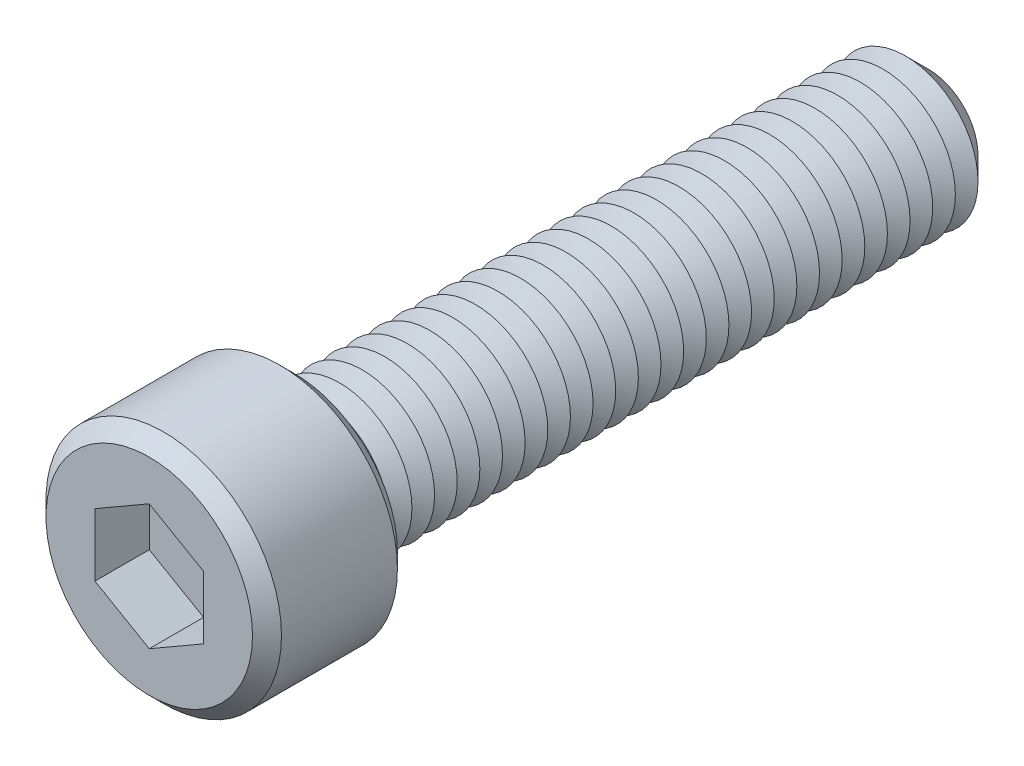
ISO-10303-21;
HEADER;
FILE_DESCRIPTION(('STEP AP214'),'2;1');
FILE_NAME('part.step','',(''),(''),'','','');
FILE_SCHEMA(('AUTOMOTIVE_DESIGN { 1 0 10303 214 1 1 1 1 }'));
ENDSEC;
DATA;
#1=APPLICATION_CONTEXT('core data for automotive mechanical design processes');
#2=APPLICATION_PROTOCOL_DEFINITION('international standard','automotive_design',2000,#1);
#3=PRODUCT_CONTEXT('',#1,'mechanical');
#4=PRODUCT('Part','Part','',(#3));
#5=PRODUCT_RELATED_PRODUCT_CATEGORY('part','',(#4));
#6=PRODUCT_DEFINITION_FORMATION('','',#4);
#7=PRODUCT_DEFINITION_CONTEXT('part definition',#1,'design');
#8=PRODUCT_DEFINITION('design','',#6,#7);
#9=PRODUCT_DEFINITION_SHAPE('','',#8);
#10=(LENGTH_UNIT() NAMED_UNIT(*) SI_UNIT(.MILLI.,.METRE.));
#11=(NAMED_UNIT(*) PLANE_ANGLE_UNIT() SI_UNIT($,.RADIAN.));
#12=(NAMED_UNIT(*) SI_UNIT($,.STERADIAN.) SOLID_ANGLE_UNIT());
#13=UNCERTAINTY_MEASURE_WITH_UNIT(LENGTH_MEASURE(1.E-05),#10,'distance_accuracy_value','');
#14=(GEOMETRIC_REPRESENTATION_CONTEXT(3) GLOBAL_UNCERTAINTY_ASSIGNED_CONTEXT((#13)) GLOBAL_UNIT_ASSIGNED_CONTEXT((#10,
#11,#12)) REPRESENTATION_CONTEXT('',''));
#15=CARTESIAN_POINT('',(0.,0.,0.));
#16=DIRECTION('',(0.,0.,1.));
#17=DIRECTION('',(1.,0.,0.));
#18=AXIS2_PLACEMENT_3D('',#15,#16,#17);
#19=CARTESIAN_POINT('',(0.,0.,8.));
#20=DIRECTION('',(0.,0.,-1.));
#21=DIRECTION('',(-1.,0.,0.));
#22=AXIS2_PLACEMENT_3D('',#19,#20,#21);
#23=CYLINDRICAL_SURFACE('',#22,6.5);
#24=CARTESIAN_POINT('',(0.,0.,0.80000000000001));
#25=DIRECTION('',(0.,0.,1.));
#26=DIRECTION('',(1.,0.,0.));
#27=AXIS2_PLACEMENT_3D('',#24,#25,#26);
#28=CIRCLE('',#27,6.5);
#29=CARTESIAN_POINT('',(6.5,0.,0.80000000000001));
#30=VERTEX_POINT('',#29);
#31=EDGE_CURVE('E392',#30,#30,#28,.T.);
#32=ORIENTED_EDGE('',*,*,#31,.T.);
#33=EDGE_LOOP('',(#32));
#34=FACE_BOUND('',#33,.T.);
#35=CARTESIAN_POINT('',(0.,0.,7.19999999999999));
#36=DIRECTION('',(0.,0.,1.));
#37=DIRECTION('',(1.,0.,0.));
#38=AXIS2_PLACEMENT_3D('',#35,#36,#37);
#39=CIRCLE('',#38,6.5);
#40=CARTESIAN_POINT('',(6.5,0.,7.19999999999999));
#41=VERTEX_POINT('',#40);
#42=EDGE_CURVE('E388',#41,#41,#39,.F.);
#43=ORIENTED_EDGE('',*,*,#42,.T.);
#44=EDGE_LOOP('',(#43));
#45=FACE_BOUND('',#44,.T.);
#46=ADVANCED_FACE('F39',(#34,#45),#23,.T.);
#47=CARTESIAN_POINT('',(0.,0.,8.));
#48=DIRECTION('',(0.,0.,1.));
#49=DIRECTION('',(1.,0.,0.));
#50=AXIS2_PLACEMENT_3D('',#47,#48,#49);
#51=PLANE('',#50);
#52=CARTESIAN_POINT('',(0.,0.,8.));
#53=DIRECTION('',(0.,0.,1.));
#54=DIRECTION('',(1.,0.,0.));
#55=AXIS2_PLACEMENT_3D('',#52,#53,#54);
#56=CIRCLE('',#55,5.69999999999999);
#57=CARTESIAN_POINT('',(5.69999999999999,0.,8.));
#58=VERTEX_POINT('',#57);
#59=EDGE_CURVE('E11',#58,#58,#56,.T.);
#60=ORIENTED_EDGE('',*,*,#59,.T.);
#61=EDGE_LOOP('',(#60));
#62=FACE_BOUND('',#61,.T.);
#63=DIRECTION('',(-0.866025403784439,0.5,0.));
#64=VECTOR('',#63,1.);
#65=CARTESIAN_POINT('',(3.,1.73205080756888,8.));
#66=LINE('',#65,#64);
#67=CARTESIAN_POINT('',(3.,1.73205080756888,8.));
#68=VERTEX_POINT('',#67);
#69=CARTESIAN_POINT('',(0.,3.46410161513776,8.));
#70=VERTEX_POINT('',#69);
#71=EDGE_CURVE('E55',#68,#70,#66,.T.);
#72=ORIENTED_EDGE('',*,*,#71,.F.);
#73=DIRECTION('',(0.,1.,0.));
#74=VECTOR('',#73,1.);
#75=CARTESIAN_POINT('',(3.,-1.73205080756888,8.));
#76=LINE('',#75,#74);
#77=CARTESIAN_POINT('',(3.,-1.73205080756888,8.));
#78=VERTEX_POINT('',#77);
#79=EDGE_CURVE('E150',#78,#68,#76,.T.);
#80=ORIENTED_EDGE('',*,*,#79,.F.);
#81=DIRECTION('',(0.866025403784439,0.5,0.));
#82=VECTOR('',#81,1.);
#83=CARTESIAN_POINT('',(0.,-3.46410161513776,8.));
#84=LINE('',#83,#82);
#85=CARTESIAN_POINT('',(0.,-3.46410161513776,8.));
#86=VERTEX_POINT('',#85);
#87=EDGE_CURVE('E147',#86,#78,#84,.T.);
#88=ORIENTED_EDGE('',*,*,#87,.F.);
#89=DIRECTION('',(0.866025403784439,-0.5,0.));
#90=VECTOR('',#89,1.);
#91=CARTESIAN_POINT('',(-3.,-1.73205080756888,8.));
#92=LINE('',#91,#90);
#93=CARTESIAN_POINT('',(-3.,-1.73205080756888,8.));
#94=VERTEX_POINT('',#93);
#95=EDGE_CURVE('E103',#94,#86,#92,.T.);
#96=ORIENTED_EDGE('',*,*,#95,.F.);
#97=DIRECTION('',(0.,-1.,0.));
#98=VECTOR('',#97,1.);
#99=CARTESIAN_POINT('',(-3.,1.73205080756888,8.));
#100=LINE('',#99,#98);
#101=CARTESIAN_POINT('',(-3.,1.73205080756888,8.));
#102=VERTEX_POINT('',#101);
#103=EDGE_CURVE('E141',#102,#94,#100,.T.);
#104=ORIENTED_EDGE('',*,*,#103,.F.);
#105=DIRECTION('',(-0.866025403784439,-0.5,0.));
#106=VECTOR('',#105,1.);
#107=CARTESIAN_POINT('',(0.,3.46410161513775,8.));
#108=LINE('',#107,#106);
#109=EDGE_CURVE('E136',#70,#102,#108,.T.);
#110=ORIENTED_EDGE('',*,*,#109,.F.);
#111=EDGE_LOOP('',(#72,#80,#88,#96,#104,#110));
#112=FACE_BOUND('',#111,.T.);
#113=ADVANCED_FACE('F410',(#62,#112),#51,.T.);
#114=CARTESIAN_POINT('',(0.,0.,0.));
#115=DIRECTION('',(0.,0.,1.));
#116=DIRECTION('',(1.,0.,0.));
#117=AXIS2_PLACEMENT_3D('',#114,#115,#116);
#118=PLANE('',#117);
#119=CARTESIAN_POINT('',(0.,0.,0.));
#120=DIRECTION('',(0.,0.,1.));
#121=DIRECTION('',(1.,0.,0.));
#122=AXIS2_PLACEMENT_3D('',#119,#120,#121);
#123=CIRCLE('',#122,5.69999999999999);
#124=CARTESIAN_POINT('',(5.69999999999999,0.,0.));
#125=VERTEX_POINT('',#124);
#126=EDGE_CURVE('E48',#125,#125,#123,.F.);
#127=ORIENTED_EDGE('',*,*,#126,.T.);
#128=EDGE_LOOP('',(#127));
#129=FACE_BOUND('',#128,.T.);
#130=CARTESIAN_POINT('',(0.,0.,0.));
#131=DIRECTION('',(0.,0.,1.));
#132=DIRECTION('',(1.,0.,0.));
#133=AXIS2_PLACEMENT_3D('',#130,#131,#132);
#134=CIRCLE('',#133,4.);
#135=CARTESIAN_POINT('',(4.,0.,0.));
#136=VERTEX_POINT('',#135);
#137=EDGE_CURVE('E380',#136,#136,#134,.T.);
#138=ORIENTED_EDGE('',*,*,#137,.T.);
#139=EDGE_LOOP('',(#138));
#140=FACE_BOUND('',#139,.T.);
#141=ADVANCED_FACE('F399',(#129,#140),#118,.F.);
#142=CARTESIAN_POINT('',(0.,0.,0.));
#143=DIRECTION('',(0.,0.,1.));
#144=DIRECTION('',(1.,0.,0.));
#145=AXIS2_PLACEMENT_3D('',#142,#143,#144);
#146=CONICAL_SURFACE('',#145,4.,1.0471975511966);
#147=CARTESIAN_POINT('',(0.,0.,-0.624999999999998));
#148=DIRECTION('',(0.,0.,1.));
#149=DIRECTION('',(1.,0.,0.));
#150=AXIS2_PLACEMENT_3D('',#147,#148,#149);
#151=CIRCLE('',#150,2.91746824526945);
#152=CARTESIAN_POINT('',(2.91746824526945,0.,-0.624999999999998));
#153=VERTEX_POINT('',#152);
#154=EDGE_CURVE('E376',#153,#153,#151,.T.);
#155=ORIENTED_EDGE('',*,*,#154,.T.);
#156=EDGE_LOOP('',(#155));
#157=FACE_BOUND('',#156,.T.);
#158=ORIENTED_EDGE('',*,*,#137,.F.);
#159=EDGE_LOOP('',(#158));
#160=FACE_BOUND('',#159,.T.);
#161=ADVANCED_FACE('F676',(#157,#160),#146,.T.);
#162=CARTESIAN_POINT('',(0.,0.,-0.624999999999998));
#163=DIRECTION('',(0.,0.,-1.));
#164=DIRECTION('',(-1.,0.,0.));
#165=AXIS2_PLACEMENT_3D('',#162,#163,#164);
#166=CONICAL_SURFACE('',#165,2.91746824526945,1.0471975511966);
#167=CARTESIAN_POINT('',(0.,0.,-1.25));
#168=DIRECTION('',(0.,0.,1.));
#169=DIRECTION('',(1.,0.,0.));
#170=AXIS2_PLACEMENT_3D('',#167,#168,#169);
#171=CIRCLE('',#170,4.);
#172=CARTESIAN_POINT('',(4.,0.,-1.25));
#173=VERTEX_POINT('',#172);
#174=EDGE_CURVE('E372',#173,#173,#171,.T.);
#175=ORIENTED_EDGE('',*,*,#174,.T.);
#176=EDGE_LOOP('',(#175));
#177=FACE_BOUND('',#176,.T.);
#178=ORIENTED_EDGE('',*,*,#154,.F.);
#179=EDGE_LOOP('',(#178));
#180=FACE_BOUND('',#179,.T.);
#181=ADVANCED_FACE('F672',(#177,#180),#166,.T.);
#182=CARTESIAN_POINT('',(0.,0.,-1.25));
#183=DIRECTION('',(0.,0.,1.));
#184=DIRECTION('',(1.,0.,0.));
#185=AXIS2_PLACEMENT_3D('',#182,#183,#184);
#186=CONICAL_SURFACE('',#185,4.,1.0471975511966);
#187=CARTESIAN_POINT('',(0.,0.,-1.875));
#188=DIRECTION('',(0.,0.,1.));
#189=DIRECTION('',(1.,0.,0.));
#190=AXIS2_PLACEMENT_3D('',#187,#188,#189);
#191=CIRCLE('',#190,2.91746824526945);
#192=CARTESIAN_POINT('',(2.91746824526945,0.,-1.875));
#193=VERTEX_POINT('',#192);
#194=EDGE_CURVE('E368',#193,#193,#191,.T.);
#195=ORIENTED_EDGE('',*,*,#194,.T.);
#196=EDGE_LOOP('',(#195));
#197=FACE_BOUND('',#196,.T.);
#198=ORIENTED_EDGE('',*,*,#174,.F.);
#199=EDGE_LOOP('',(#198));
#200=FACE_BOUND('',#199,.T.);
#201=ADVANCED_FACE('F668',(#197,#200),#186,.T.);
#202=CARTESIAN_POINT('',(0.,0.,-1.875));
#203=DIRECTION('',(0.,0.,-1.));
#204=DIRECTION('',(-1.,0.,0.));
#205=AXIS2_PLACEMENT_3D('',#202,#203,#204);
#206=CONICAL_SURFACE('',#205,2.91746824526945,1.0471975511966);
#207=CARTESIAN_POINT('',(0.,0.,-2.5));
#208=DIRECTION('',(0.,0.,1.));
#209=DIRECTION('',(1.,0.,0.));
#210=AXIS2_PLACEMENT_3D('',#207,#208,#209);
#211=CIRCLE('',#210,4.);
#212=CARTESIAN_POINT('',(4.,0.,-2.5));
#213=VERTEX_POINT('',#212);
#214=EDGE_CURVE('E364',#213,#213,#211,.T.);
#215=ORIENTED_EDGE('',*,*,#214,.T.);
#216=EDGE_LOOP('',(#215));
#217=FACE_BOUND('',#216,.T.);
#218=ORIENTED_EDGE('',*,*,#194,.F.);
#219=EDGE_LOOP('',(#218));
#220=FACE_BOUND('',#219,.T.);
#221=ADVANCED_FACE('F664',(#217,#220),#206,.T.);
#222=CARTESIAN_POINT('',(0.,0.,-2.5));
#223=DIRECTION('',(0.,0.,1.));
#224=DIRECTION('',(1.,0.,0.));
#225=AXIS2_PLACEMENT_3D('',#222,#223,#224);
#226=CONICAL_SURFACE('',#225,4.,1.0471975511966);
#227=CARTESIAN_POINT('',(0.,0.,-3.125));
#228=DIRECTION('',(0.,0.,1.));
#229=DIRECTION('',(1.,0.,0.));
#230=AXIS2_PLACEMENT_3D('',#227,#228,#229);
#231=CIRCLE('',#230,2.91746824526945);
#232=CARTESIAN_POINT('',(2.91746824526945,0.,-3.125));
#233=VERTEX_POINT('',#232);
#234=EDGE_CURVE('E360',#233,#233,#231,.T.);
#235=ORIENTED_EDGE('',*,*,#234,.T.);
#236=EDGE_LOOP('',(#235));
#237=FACE_BOUND('',#236,.T.);
#238=ORIENTED_EDGE('',*,*,#214,.F.);
#239=EDGE_LOOP('',(#238));
#240=FACE_BOUND('',#239,.T.);
#241=ADVANCED_FACE('F660',(#237,#240),#226,.T.);
#242=CARTESIAN_POINT('',(0.,0.,-3.125));
#243=DIRECTION('',(0.,0.,-1.));
#244=DIRECTION('',(-1.,0.,0.));
#245=AXIS2_PLACEMENT_3D('',#242,#243,#244);
#246=CONICAL_SURFACE('',#245,2.91746824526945,1.0471975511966);
#247=CARTESIAN_POINT('',(0.,0.,-3.75));
#248=DIRECTION('',(0.,0.,1.));
#249=DIRECTION('',(1.,0.,0.));
#250=AXIS2_PLACEMENT_3D('',#247,#248,#249);
#251=CIRCLE('',#250,4.);
#252=CARTESIAN_POINT('',(4.,0.,-3.75));
#253=VERTEX_POINT('',#252);
#254=EDGE_CURVE('E356',#253,#253,#251,.T.);
#255=ORIENTED_EDGE('',*,*,#254,.T.);
#256=EDGE_LOOP('',(#255));
#257=FACE_BOUND('',#256,.T.);
#258=ORIENTED_EDGE('',*,*,#234,.F.);
#259=EDGE_LOOP('',(#258));
#260=FACE_BOUND('',#259,.T.);
#261=ADVANCED_FACE('F656',(#257,#260),#246,.T.);
#262=CARTESIAN_POINT('',(0.,0.,-3.75));
#263=DIRECTION('',(0.,0.,1.));
#264=DIRECTION('',(1.,0.,0.));
#265=AXIS2_PLACEMENT_3D('',#262,#263,#264);
#266=CONICAL_SURFACE('',#265,4.,1.0471975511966);
#267=CARTESIAN_POINT('',(0.,0.,-4.375));
#268=DIRECTION('',(0.,0.,1.));
#269=DIRECTION('',(1.,0.,0.));
#270=AXIS2_PLACEMENT_3D('',#267,#268,#269);
#271=CIRCLE('',#270,2.91746824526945);
#272=CARTESIAN_POINT('',(2.91746824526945,0.,-4.375));
#273=VERTEX_POINT('',#272);
#274=EDGE_CURVE('E352',#273,#273,#271,.T.);
#275=ORIENTED_EDGE('',*,*,#274,.T.);
#276=EDGE_LOOP('',(#275));
#277=FACE_BOUND('',#276,.T.);
#278=ORIENTED_EDGE('',*,*,#254,.F.);
#279=EDGE_LOOP('',(#278));
#280=FACE_BOUND('',#279,.T.);
#281=ADVANCED_FACE('F652',(#277,#280),#266,.T.);
#282=CARTESIAN_POINT('',(0.,0.,-4.375));
#283=DIRECTION('',(0.,0.,-1.));
#284=DIRECTION('',(-1.,0.,0.));
#285=AXIS2_PLACEMENT_3D('',#282,#283,#284);
#286=CONICAL_SURFACE('',#285,2.91746824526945,1.0471975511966);
#287=CARTESIAN_POINT('',(0.,0.,-5.));
#288=DIRECTION('',(0.,0.,1.));
#289=DIRECTION('',(1.,0.,0.));
#290=AXIS2_PLACEMENT_3D('',#287,#288,#289);
#291=CIRCLE('',#290,4.);
#292=CARTESIAN_POINT('',(4.,0.,-5.));
#293=VERTEX_POINT('',#292);
#294=EDGE_CURVE('E348',#293,#293,#291,.T.);
#295=ORIENTED_EDGE('',*,*,#294,.T.);
#296=EDGE_LOOP('',(#295));
#297=FACE_BOUND('',#296,.T.);
#298=ORIENTED_EDGE('',*,*,#274,.F.);
#299=EDGE_LOOP('',(#298));
#300=FACE_BOUND('',#299,.T.);
#301=ADVANCED_FACE('F648',(#297,#300),#286,.T.);
#302=CARTESIAN_POINT('',(0.,0.,-5.));
#303=DIRECTION('',(0.,0.,1.));
#304=DIRECTION('',(1.,0.,0.));
#305=AXIS2_PLACEMENT_3D('',#302,#303,#304);
#306=CONICAL_SURFACE('',#305,4.,1.0471975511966);
#307=CARTESIAN_POINT('',(0.,0.,-5.625));
#308=DIRECTION('',(0.,0.,1.));
#309=DIRECTION('',(1.,0.,0.));
#310=AXIS2_PLACEMENT_3D('',#307,#308,#309);
#311=CIRCLE('',#310,2.91746824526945);
#312=CARTESIAN_POINT('',(2.91746824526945,0.,-5.625));
#313=VERTEX_POINT('',#312);
#314=EDGE_CURVE('E344',#313,#313,#311,.T.);
#315=ORIENTED_EDGE('',*,*,#314,.T.);
#316=EDGE_LOOP('',(#315));
#317=FACE_BOUND('',#316,.T.);
#318=ORIENTED_EDGE('',*,*,#294,.F.);
#319=EDGE_LOOP('',(#318));
#320=FACE_BOUND('',#319,.T.);
#321=ADVANCED_FACE('F644',(#317,#320),#306,.T.);
#322=CARTESIAN_POINT('',(0.,0.,-5.625));
#323=DIRECTION('',(0.,0.,-1.));
#324=DIRECTION('',(-1.,0.,0.));
#325=AXIS2_PLACEMENT_3D('',#322,#323,#324);
#326=CONICAL_SURFACE('',#325,2.91746824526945,1.0471975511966);
#327=CARTESIAN_POINT('',(0.,0.,-6.25));
#328=DIRECTION('',(0.,0.,1.));
#329=DIRECTION('',(1.,0.,0.));
#330=AXIS2_PLACEMENT_3D('',#327,#328,#329);
#331=CIRCLE('',#330,4.);
#332=CARTESIAN_POINT('',(4.,0.,-6.25));
#333=VERTEX_POINT('',#332);
#334=EDGE_CURVE('E340',#333,#333,#331,.T.);
#335=ORIENTED_EDGE('',*,*,#334,.T.);
#336=EDGE_LOOP('',(#335));
#337=FACE_BOUND('',#336,.T.);
#338=ORIENTED_EDGE('',*,*,#314,.F.);
#339=EDGE_LOOP('',(#338));
#340=FACE_BOUND('',#339,.T.);
#341=ADVANCED_FACE('F640',(#337,#340),#326,.T.);
#342=CARTESIAN_POINT('',(0.,0.,-6.25));
#343=DIRECTION('',(0.,0.,1.));
#344=DIRECTION('',(1.,0.,0.));
#345=AXIS2_PLACEMENT_3D('',#342,#343,#344);
#346=CONICAL_SURFACE('',#345,4.,1.0471975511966);
#347=CARTESIAN_POINT('',(0.,0.,-6.875));
#348=DIRECTION('',(0.,0.,1.));
#349=DIRECTION('',(1.,0.,0.));
#350=AXIS2_PLACEMENT_3D('',#347,#348,#349);
#351=CIRCLE('',#350,2.91746824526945);
#352=CARTESIAN_POINT('',(2.91746824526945,0.,-6.875));
#353=VERTEX_POINT('',#352);
#354=EDGE_CURVE('E336',#353,#353,#351,.T.);
#355=ORIENTED_EDGE('',*,*,#354,.T.);
#356=EDGE_LOOP('',(#355));
#357=FACE_BOUND('',#356,.T.);
#358=ORIENTED_EDGE('',*,*,#334,.F.);
#359=EDGE_LOOP('',(#358));
#360=FACE_BOUND('',#359,.T.);
#361=ADVANCED_FACE('F636',(#357,#360),#346,.T.);
#362=CARTESIAN_POINT('',(0.,0.,-6.875));
#363=DIRECTION('',(0.,0.,-1.));
#364=DIRECTION('',(-1.,0.,0.));
#365=AXIS2_PLACEMENT_3D('',#362,#363,#364);
#366=CONICAL_SURFACE('',#365,2.91746824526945,1.0471975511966);
#367=CARTESIAN_POINT('',(0.,0.,-7.5));
#368=DIRECTION('',(0.,0.,1.));
#369=DIRECTION('',(1.,0.,0.));
#370=AXIS2_PLACEMENT_3D('',#367,#368,#369);
#371=CIRCLE('',#370,4.);
#372=CARTESIAN_POINT('',(4.,0.,-7.5));
#373=VERTEX_POINT('',#372);
#374=EDGE_CURVE('E332',#373,#373,#371,.T.);
#375=ORIENTED_EDGE('',*,*,#374,.T.);
#376=EDGE_LOOP('',(#375));
#377=FACE_BOUND('',#376,.T.);
#378=ORIENTED_EDGE('',*,*,#354,.F.);
#379=EDGE_LOOP('',(#378));
#380=FACE_BOUND('',#379,.T.);
#381=ADVANCED_FACE('F632',(#377,#380),#366,.T.);
#382=CARTESIAN_POINT('',(0.,0.,-7.5));
#383=DIRECTION('',(0.,0.,1.));
#384=DIRECTION('',(1.,0.,0.));
#385=AXIS2_PLACEMENT_3D('',#382,#383,#384);
#386=CONICAL_SURFACE('',#385,4.,1.0471975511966);
#387=CARTESIAN_POINT('',(0.,0.,-8.125));
#388=DIRECTION('',(0.,0.,1.));
#389=DIRECTION('',(1.,0.,0.));
#390=AXIS2_PLACEMENT_3D('',#387,#388,#389);
#391=CIRCLE('',#390,2.91746824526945);
#392=CARTESIAN_POINT('',(2.91746824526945,0.,-8.125));
#393=VERTEX_POINT('',#392);
#394=EDGE_CURVE('E328',#393,#393,#391,.T.);
#395=ORIENTED_EDGE('',*,*,#394,.T.);
#396=EDGE_LOOP('',(#395));
#397=FACE_BOUND('',#396,.T.);
#398=ORIENTED_EDGE('',*,*,#374,.F.);
#399=EDGE_LOOP('',(#398));
#400=FACE_BOUND('',#399,.T.);
#401=ADVANCED_FACE('F628',(#397,#400),#386,.T.);
#402=CARTESIAN_POINT('',(0.,0.,-8.125));
#403=DIRECTION('',(0.,0.,-1.));
#404=DIRECTION('',(-1.,0.,0.));
#405=AXIS2_PLACEMENT_3D('',#402,#403,#404);
#406=CONICAL_SURFACE('',#405,2.91746824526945,1.0471975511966);
#407=CARTESIAN_POINT('',(0.,0.,-8.75));
#408=DIRECTION('',(0.,0.,1.));
#409=DIRECTION('',(1.,0.,0.));
#410=AXIS2_PLACEMENT_3D('',#407,#408,#409);
#411=CIRCLE('',#410,4.);
#412=CARTESIAN_POINT('',(4.,0.,-8.75));
#413=VERTEX_POINT('',#412);
#414=EDGE_CURVE('E324',#413,#413,#411,.T.);
#415=ORIENTED_EDGE('',*,*,#414,.T.);
#416=EDGE_LOOP('',(#415));
#417=FACE_BOUND('',#416,.T.);
#418=ORIENTED_EDGE('',*,*,#394,.F.);
#419=EDGE_LOOP('',(#418));
#420=FACE_BOUND('',#419,.T.);
#421=ADVANCED_FACE('F624',(#417,#420),#406,.T.);
#422=CARTESIAN_POINT('',(0.,0.,-8.75));
#423=DIRECTION('',(0.,0.,1.));
#424=DIRECTION('',(1.,0.,0.));
#425=AXIS2_PLACEMENT_3D('',#422,#423,#424);
#426=CONICAL_SURFACE('',#425,4.,1.0471975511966);
#427=CARTESIAN_POINT('',(0.,0.,-9.375));
#428=DIRECTION('',(0.,0.,1.));
#429=DIRECTION('',(1.,0.,0.));
#430=AXIS2_PLACEMENT_3D('',#427,#428,#429);
#431=CIRCLE('',#430,2.91746824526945);
#432=CARTESIAN_POINT('',(2.91746824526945,0.,-9.375));
#433=VERTEX_POINT('',#432);
#434=EDGE_CURVE('E320',#433,#433,#431,.T.);
#435=ORIENTED_EDGE('',*,*,#434,.T.);
#436=EDGE_LOOP('',(#435));
#437=FACE_BOUND('',#436,.T.);
#438=ORIENTED_EDGE('',*,*,#414,.F.);
#439=EDGE_LOOP('',(#438));
#440=FACE_BOUND('',#439,.T.);
#441=ADVANCED_FACE('F620',(#437,#440),#426,.T.);
#442=CARTESIAN_POINT('',(0.,0.,-9.375));
#443=DIRECTION('',(0.,0.,-1.));
#444=DIRECTION('',(-1.,0.,0.));
#445=AXIS2_PLACEMENT_3D('',#442,#443,#444);
#446=CONICAL_SURFACE('',#445,2.91746824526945,1.0471975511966);
#447=CARTESIAN_POINT('',(0.,0.,-10.));
#448=DIRECTION('',(0.,0.,1.));
#449=DIRECTION('',(1.,0.,0.));
#450=AXIS2_PLACEMENT_3D('',#447,#448,#449);
#451=CIRCLE('',#450,4.);
#452=CARTESIAN_POINT('',(4.,0.,-10.));
#453=VERTEX_POINT('',#452);
#454=EDGE_CURVE('E316',#453,#453,#451,.T.);
#455=ORIENTED_EDGE('',*,*,#454,.T.);
#456=EDGE_LOOP('',(#455));
#457=FACE_BOUND('',#456,.T.);
#458=ORIENTED_EDGE('',*,*,#434,.F.);
#459=EDGE_LOOP('',(#458));
#460=FACE_BOUND('',#459,.T.);
#461=ADVANCED_FACE('F616',(#457,#460),#446,.T.);
#462=CARTESIAN_POINT('',(0.,0.,-10.));
#463=DIRECTION('',(0.,0.,1.));
#464=DIRECTION('',(1.,0.,0.));
#465=AXIS2_PLACEMENT_3D('',#462,#463,#464);
#466=CONICAL_SURFACE('',#465,4.,1.0471975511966);
#467=CARTESIAN_POINT('',(0.,0.,-10.625));
#468=DIRECTION('',(0.,0.,1.));
#469=DIRECTION('',(1.,0.,0.));
#470=AXIS2_PLACEMENT_3D('',#467,#468,#469);
#471=CIRCLE('',#470,2.91746824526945);
#472=CARTESIAN_POINT('',(2.91746824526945,0.,-10.625));
#473=VERTEX_POINT('',#472);
#474=EDGE_CURVE('E312',#473,#473,#471,.T.);
#475=ORIENTED_EDGE('',*,*,#474,.T.);
#476=EDGE_LOOP('',(#475));
#477=FACE_BOUND('',#476,.T.);
#478=ORIENTED_EDGE('',*,*,#454,.F.);
#479=EDGE_LOOP('',(#478));
#480=FACE_BOUND('',#479,.T.);
#481=ADVANCED_FACE('F612',(#477,#480),#466,.T.);
#482=CARTESIAN_POINT('',(0.,0.,-10.625));
#483=DIRECTION('',(0.,0.,-1.));
#484=DIRECTION('',(-1.,0.,0.));
#485=AXIS2_PLACEMENT_3D('',#482,#483,#484);
#486=CONICAL_SURFACE('',#485,2.91746824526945,1.0471975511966);
#487=CARTESIAN_POINT('',(0.,0.,-11.25));
#488=DIRECTION('',(0.,0.,1.));
#489=DIRECTION('',(1.,0.,0.));
#490=AXIS2_PLACEMENT_3D('',#487,#488,#489);
#491=CIRCLE('',#490,4.);
#492=CARTESIAN_POINT('',(4.,0.,-11.25));
#493=VERTEX_POINT('',#492);
#494=EDGE_CURVE('E308',#493,#493,#491,.T.);
#495=ORIENTED_EDGE('',*,*,#494,.T.);
#496=EDGE_LOOP('',(#495));
#497=FACE_BOUND('',#496,.T.);
#498=ORIENTED_EDGE('',*,*,#474,.F.);
#499=EDGE_LOOP('',(#498));
#500=FACE_BOUND('',#499,.T.);
#501=ADVANCED_FACE('F608',(#497,#500),#486,.T.);
#502=CARTESIAN_POINT('',(0.,0.,-11.25));
#503=DIRECTION('',(0.,0.,1.));
#504=DIRECTION('',(1.,0.,0.));
#505=AXIS2_PLACEMENT_3D('',#502,#503,#504);
#506=CONICAL_SURFACE('',#505,4.,1.0471975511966);
#507=CARTESIAN_POINT('',(0.,0.,-11.875));
#508=DIRECTION('',(0.,0.,1.));
#509=DIRECTION('',(1.,0.,0.));
#510=AXIS2_PLACEMENT_3D('',#507,#508,#509);
#511=CIRCLE('',#510,2.91746824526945);
#512=CARTESIAN_POINT('',(2.91746824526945,0.,-11.875));
#513=VERTEX_POINT('',#512);
#514=EDGE_CURVE('E304',#513,#513,#511,.T.);
#515=ORIENTED_EDGE('',*,*,#514,.T.);
#516=EDGE_LOOP('',(#515));
#517=FACE_BOUND('',#516,.T.);
#518=ORIENTED_EDGE('',*,*,#494,.F.);
#519=EDGE_LOOP('',(#518));
#520=FACE_BOUND('',#519,.T.);
#521=ADVANCED_FACE('F604',(#517,#520),#506,.T.);
#522=CARTESIAN_POINT('',(0.,0.,-11.875));
#523=DIRECTION('',(0.,0.,-1.));
#524=DIRECTION('',(-1.,0.,0.));
#525=AXIS2_PLACEMENT_3D('',#522,#523,#524);
#526=CONICAL_SURFACE('',#525,2.91746824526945,1.0471975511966);
#527=CARTESIAN_POINT('',(0.,0.,-12.5));
#528=DIRECTION('',(0.,0.,1.));
#529=DIRECTION('',(1.,0.,0.));
#530=AXIS2_PLACEMENT_3D('',#527,#528,#529);
#531=CIRCLE('',#530,4.);
#532=CARTESIAN_POINT('',(4.,0.,-12.5));
#533=VERTEX_POINT('',#532);
#534=EDGE_CURVE('E300',#533,#533,#531,.T.);
#535=ORIENTED_EDGE('',*,*,#534,.T.);
#536=EDGE_LOOP('',(#535));
#537=FACE_BOUND('',#536,.T.);
#538=ORIENTED_EDGE('',*,*,#514,.F.);
#539=EDGE_LOOP('',(#538));
#540=FACE_BOUND('',#539,.T.);
#541=ADVANCED_FACE('F600',(#537,#540),#526,.T.);
#542=CARTESIAN_POINT('',(0.,0.,-12.5));
#543=DIRECTION('',(0.,0.,1.));
#544=DIRECTION('',(1.,0.,0.));
#545=AXIS2_PLACEMENT_3D('',#542,#543,#544);
#546=CONICAL_SURFACE('',#545,4.,1.0471975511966);
#547=CARTESIAN_POINT('',(0.,0.,-13.125));
#548=DIRECTION('',(0.,0.,1.));
#549=DIRECTION('',(1.,0.,0.));
#550=AXIS2_PLACEMENT_3D('',#547,#548,#549);
#551=CIRCLE('',#550,2.91746824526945);
#552=CARTESIAN_POINT('',(2.91746824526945,0.,-13.125));
#553=VERTEX_POINT('',#552);
#554=EDGE_CURVE('E296',#553,#553,#551,.T.);
#555=ORIENTED_EDGE('',*,*,#554,.T.);
#556=EDGE_LOOP('',(#555));
#557=FACE_BOUND('',#556,.T.);
#558=ORIENTED_EDGE('',*,*,#534,.F.);
#559=EDGE_LOOP('',(#558));
#560=FACE_BOUND('',#559,.T.);
#561=ADVANCED_FACE('F596',(#557,#560),#546,.T.);
#562=CARTESIAN_POINT('',(0.,0.,-13.125));
#563=DIRECTION('',(0.,0.,-1.));
#564=DIRECTION('',(-1.,0.,0.));
#565=AXIS2_PLACEMENT_3D('',#562,#563,#564);
#566=CONICAL_SURFACE('',#565,2.91746824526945,1.0471975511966);
#567=CARTESIAN_POINT('',(0.,0.,-13.75));
#568=DIRECTION('',(0.,0.,1.));
#569=DIRECTION('',(1.,0.,0.));
#570=AXIS2_PLACEMENT_3D('',#567,#568,#569);
#571=CIRCLE('',#570,4.);
#572=CARTESIAN_POINT('',(4.,0.,-13.75));
#573=VERTEX_POINT('',#572);
#574=EDGE_CURVE('E292',#573,#573,#571,.T.);
#575=ORIENTED_EDGE('',*,*,#574,.T.);
#576=EDGE_LOOP('',(#575));
#577=FACE_BOUND('',#576,.T.);
#578=ORIENTED_EDGE('',*,*,#554,.F.);
#579=EDGE_LOOP('',(#578));
#580=FACE_BOUND('',#579,.T.);
#581=ADVANCED_FACE('F592',(#577,#580),#566,.T.);
#582=CARTESIAN_POINT('',(0.,0.,-13.75));
#583=DIRECTION('',(0.,0.,1.));
#584=DIRECTION('',(1.,0.,0.));
#585=AXIS2_PLACEMENT_3D('',#582,#583,#584);
#586=CONICAL_SURFACE('',#585,4.,1.0471975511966);
#587=CARTESIAN_POINT('',(0.,0.,-14.375));
#588=DIRECTION('',(0.,0.,1.));
#589=DIRECTION('',(1.,0.,0.));
#590=AXIS2_PLACEMENT_3D('',#587,#588,#589);
#591=CIRCLE('',#590,2.91746824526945);
#592=CARTESIAN_POINT('',(2.91746824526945,0.,-14.375));
#593=VERTEX_POINT('',#592);
#594=EDGE_CURVE('E288',#593,#593,#591,.T.);
#595=ORIENTED_EDGE('',*,*,#594,.T.);
#596=EDGE_LOOP('',(#595));
#597=FACE_BOUND('',#596,.T.);
#598=ORIENTED_EDGE('',*,*,#574,.F.);
#599=EDGE_LOOP('',(#598));
#600=FACE_BOUND('',#599,.T.);
#601=ADVANCED_FACE('F588',(#597,#600),#586,.T.);
#602=CARTESIAN_POINT('',(0.,0.,-14.375));
#603=DIRECTION('',(0.,0.,-1.));
#604=DIRECTION('',(-1.,0.,0.));
#605=AXIS2_PLACEMENT_3D('',#602,#603,#604);
#606=CONICAL_SURFACE('',#605,2.91746824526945,1.0471975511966);
#607=CARTESIAN_POINT('',(0.,0.,-15.));
#608=DIRECTION('',(0.,0.,1.));
#609=DIRECTION('',(1.,0.,0.));
#610=AXIS2_PLACEMENT_3D('',#607,#608,#609);
#611=CIRCLE('',#610,4.);
#612=CARTESIAN_POINT('',(4.,0.,-15.));
#613=VERTEX_POINT('',#612);
#614=EDGE_CURVE('E284',#613,#613,#611,.T.);
#615=ORIENTED_EDGE('',*,*,#614,.T.);
#616=EDGE_LOOP('',(#615));
#617=FACE_BOUND('',#616,.T.);
#618=ORIENTED_EDGE('',*,*,#594,.F.);
#619=EDGE_LOOP('',(#618));
#620=FACE_BOUND('',#619,.T.);
#621=ADVANCED_FACE('F584',(#617,#620),#606,.T.);
#622=CARTESIAN_POINT('',(0.,0.,-15.));
#623=DIRECTION('',(0.,0.,1.));
#624=DIRECTION('',(1.,0.,0.));
#625=AXIS2_PLACEMENT_3D('',#622,#623,#624);
#626=CONICAL_SURFACE('',#625,4.,1.0471975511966);
#627=CARTESIAN_POINT('',(0.,0.,-15.625));
#628=DIRECTION('',(0.,0.,1.));
#629=DIRECTION('',(1.,0.,0.));
#630=AXIS2_PLACEMENT_3D('',#627,#628,#629);
#631=CIRCLE('',#630,2.91746824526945);
#632=CARTESIAN_POINT('',(2.91746824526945,0.,-15.625));
#633=VERTEX_POINT('',#632);
#634=EDGE_CURVE('E280',#633,#633,#631,.T.);
#635=ORIENTED_EDGE('',*,*,#634,.T.);
#636=EDGE_LOOP('',(#635));
#637=FACE_BOUND('',#636,.T.);
#638=ORIENTED_EDGE('',*,*,#614,.F.);
#639=EDGE_LOOP('',(#638));
#640=FACE_BOUND('',#639,.T.);
#641=ADVANCED_FACE('F580',(#637,#640),#626,.T.);
#642=CARTESIAN_POINT('',(0.,0.,-15.625));
#643=DIRECTION('',(0.,0.,-1.));
#644=DIRECTION('',(-1.,0.,0.));
#645=AXIS2_PLACEMENT_3D('',#642,#643,#644);
#646=CONICAL_SURFACE('',#645,2.91746824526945,1.0471975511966);
#647=CARTESIAN_POINT('',(0.,0.,-16.25));
#648=DIRECTION('',(0.,0.,1.));
#649=DIRECTION('',(1.,0.,0.));
#650=AXIS2_PLACEMENT_3D('',#647,#648,#649);
#651=CIRCLE('',#650,4.);
#652=CARTESIAN_POINT('',(4.,0.,-16.25));
#653=VERTEX_POINT('',#652);
#654=EDGE_CURVE('E276',#653,#653,#651,.T.);
#655=ORIENTED_EDGE('',*,*,#654,.T.);
#656=EDGE_LOOP('',(#655));
#657=FACE_BOUND('',#656,.T.);
#658=ORIENTED_EDGE('',*,*,#634,.F.);
#659=EDGE_LOOP('',(#658));
#660=FACE_BOUND('',#659,.T.);
#661=ADVANCED_FACE('F576',(#657,#660),#646,.T.);
#662=CARTESIAN_POINT('',(0.,0.,-16.25));
#663=DIRECTION('',(0.,0.,1.));
#664=DIRECTION('',(1.,0.,0.));
#665=AXIS2_PLACEMENT_3D('',#662,#663,#664);
#666=CONICAL_SURFACE('',#665,4.,1.0471975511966);
#667=CARTESIAN_POINT('',(0.,0.,-16.875));
#668=DIRECTION('',(0.,0.,1.));
#669=DIRECTION('',(1.,0.,0.));
#670=AXIS2_PLACEMENT_3D('',#667,#668,#669);
#671=CIRCLE('',#670,2.91746824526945);
#672=CARTESIAN_POINT('',(2.91746824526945,0.,-16.875));
#673=VERTEX_POINT('',#672);
#674=EDGE_CURVE('E272',#673,#673,#671,.T.);
#675=ORIENTED_EDGE('',*,*,#674,.T.);
#676=EDGE_LOOP('',(#675));
#677=FACE_BOUND('',#676,.T.);
#678=ORIENTED_EDGE('',*,*,#654,.F.);
#679=EDGE_LOOP('',(#678));
#680=FACE_BOUND('',#679,.T.);
#681=ADVANCED_FACE('F572',(#677,#680),#666,.T.);
#682=CARTESIAN_POINT('',(0.,0.,-16.875));
#683=DIRECTION('',(0.,0.,-1.));
#684=DIRECTION('',(-1.,0.,0.));
#685=AXIS2_PLACEMENT_3D('',#682,#683,#684);
#686=CONICAL_SURFACE('',#685,2.91746824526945,1.0471975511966);
#687=CARTESIAN_POINT('',(0.,0.,-17.5));
#688=DIRECTION('',(0.,0.,1.));
#689=DIRECTION('',(1.,0.,0.));
#690=AXIS2_PLACEMENT_3D('',#687,#688,#689);
#691=CIRCLE('',#690,4.);
#692=CARTESIAN_POINT('',(4.,0.,-17.5));
#693=VERTEX_POINT('',#692);
#694=EDGE_CURVE('E268',#693,#693,#691,.T.);
#695=ORIENTED_EDGE('',*,*,#694,.T.);
#696=EDGE_LOOP('',(#695));
#697=FACE_BOUND('',#696,.T.);
#698=ORIENTED_EDGE('',*,*,#674,.F.);
#699=EDGE_LOOP('',(#698));
#700=FACE_BOUND('',#699,.T.);
#701=ADVANCED_FACE('F568',(#697,#700),#686,.T.);
#702=CARTESIAN_POINT('',(0.,0.,-17.5));
#703=DIRECTION('',(0.,0.,1.));
#704=DIRECTION('',(1.,0.,0.));
#705=AXIS2_PLACEMENT_3D('',#702,#703,#704);
#706=CONICAL_SURFACE('',#705,4.,1.0471975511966);
#707=CARTESIAN_POINT('',(0.,0.,-18.125));
#708=DIRECTION('',(0.,0.,1.));
#709=DIRECTION('',(1.,0.,0.));
#710=AXIS2_PLACEMENT_3D('',#707,#708,#709);
#711=CIRCLE('',#710,2.91746824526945);
#712=CARTESIAN_POINT('',(2.91746824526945,0.,-18.125));
#713=VERTEX_POINT('',#712);
#714=EDGE_CURVE('E264',#713,#713,#711,.T.);
#715=ORIENTED_EDGE('',*,*,#714,.T.);
#716=EDGE_LOOP('',(#715));
#717=FACE_BOUND('',#716,.T.);
#718=ORIENTED_EDGE('',*,*,#694,.F.);
#719=EDGE_LOOP('',(#718));
#720=FACE_BOUND('',#719,.T.);
#721=ADVANCED_FACE('F564',(#717,#720),#706,.T.);
#722=CARTESIAN_POINT('',(0.,0.,-18.125));
#723=DIRECTION('',(0.,0.,-1.));
#724=DIRECTION('',(-1.,0.,0.));
#725=AXIS2_PLACEMENT_3D('',#722,#723,#724);
#726=CONICAL_SURFACE('',#725,2.91746824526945,1.0471975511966);
#727=CARTESIAN_POINT('',(0.,0.,-18.75));
#728=DIRECTION('',(0.,0.,1.));
#729=DIRECTION('',(1.,0.,0.));
#730=AXIS2_PLACEMENT_3D('',#727,#728,#729);
#731=CIRCLE('',#730,4.);
#732=CARTESIAN_POINT('',(4.,0.,-18.75));
#733=VERTEX_POINT('',#732);
#734=EDGE_CURVE('E260',#733,#733,#731,.T.);
#735=ORIENTED_EDGE('',*,*,#734,.T.);
#736=EDGE_LOOP('',(#735));
#737=FACE_BOUND('',#736,.T.);
#738=ORIENTED_EDGE('',*,*,#714,.F.);
#739=EDGE_LOOP('',(#738));
#740=FACE_BOUND('',#739,.T.);
#741=ADVANCED_FACE('F560',(#737,#740),#726,.T.);
#742=CARTESIAN_POINT('',(0.,0.,-18.75));
#743=DIRECTION('',(0.,0.,1.));
#744=DIRECTION('',(1.,0.,0.));
#745=AXIS2_PLACEMENT_3D('',#742,#743,#744);
#746=CONICAL_SURFACE('',#745,4.,1.0471975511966);
#747=CARTESIAN_POINT('',(0.,0.,-19.375));
#748=DIRECTION('',(0.,0.,1.));
#749=DIRECTION('',(1.,0.,0.));
#750=AXIS2_PLACEMENT_3D('',#747,#748,#749);
#751=CIRCLE('',#750,2.91746824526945);
#752=CARTESIAN_POINT('',(2.91746824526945,0.,-19.375));
#753=VERTEX_POINT('',#752);
#754=EDGE_CURVE('E256',#753,#753,#751,.T.);
#755=ORIENTED_EDGE('',*,*,#754,.T.);
#756=EDGE_LOOP('',(#755));
#757=FACE_BOUND('',#756,.T.);
#758=ORIENTED_EDGE('',*,*,#734,.F.);
#759=EDGE_LOOP('',(#758));
#760=FACE_BOUND('',#759,.T.);
#761=ADVANCED_FACE('F556',(#757,#760),#746,.T.);
#762=CARTESIAN_POINT('',(0.,0.,-19.375));
#763=DIRECTION('',(0.,0.,-1.));
#764=DIRECTION('',(-1.,0.,0.));
#765=AXIS2_PLACEMENT_3D('',#762,#763,#764);
#766=CONICAL_SURFACE('',#765,2.91746824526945,1.0471975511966);
#767=CARTESIAN_POINT('',(0.,0.,-20.));
#768=DIRECTION('',(0.,0.,1.));
#769=DIRECTION('',(1.,0.,0.));
#770=AXIS2_PLACEMENT_3D('',#767,#768,#769);
#771=CIRCLE('',#770,4.);
#772=CARTESIAN_POINT('',(4.,0.,-20.));
#773=VERTEX_POINT('',#772);
#774=EDGE_CURVE('E252',#773,#773,#771,.T.);
#775=ORIENTED_EDGE('',*,*,#774,.T.);
#776=EDGE_LOOP('',(#775));
#777=FACE_BOUND('',#776,.T.);
#778=ORIENTED_EDGE('',*,*,#754,.F.);
#779=EDGE_LOOP('',(#778));
#780=FACE_BOUND('',#779,.T.);
#781=ADVANCED_FACE('F552',(#777,#780),#766,.T.);
#782=CARTESIAN_POINT('',(0.,0.,-20.));
#783=DIRECTION('',(0.,0.,1.));
#784=DIRECTION('',(1.,0.,0.));
#785=AXIS2_PLACEMENT_3D('',#782,#783,#784);
#786=CONICAL_SURFACE('',#785,4.,1.0471975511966);
#787=CARTESIAN_POINT('',(0.,0.,-20.625));
#788=DIRECTION('',(0.,0.,1.));
#789=DIRECTION('',(1.,0.,0.));
#790=AXIS2_PLACEMENT_3D('',#787,#788,#789);
#791=CIRCLE('',#790,2.91746824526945);
#792=CARTESIAN_POINT('',(2.91746824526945,0.,-20.625));
#793=VERTEX_POINT('',#792);
#794=EDGE_CURVE('E248',#793,#793,#791,.T.);
#795=ORIENTED_EDGE('',*,*,#794,.T.);
#796=EDGE_LOOP('',(#795));
#797=FACE_BOUND('',#796,.T.);
#798=ORIENTED_EDGE('',*,*,#774,.F.);
#799=EDGE_LOOP('',(#798));
#800=FACE_BOUND('',#799,.T.);
#801=ADVANCED_FACE('F548',(#797,#800),#786,.T.);
#802=CARTESIAN_POINT('',(0.,0.,-20.625));
#803=DIRECTION('',(0.,0.,-1.));
#804=DIRECTION('',(-1.,0.,0.));
#805=AXIS2_PLACEMENT_3D('',#802,#803,#804);
#806=CONICAL_SURFACE('',#805,2.91746824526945,1.0471975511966);
#807=CARTESIAN_POINT('',(0.,0.,-21.25));
#808=DIRECTION('',(0.,0.,1.));
#809=DIRECTION('',(1.,0.,0.));
#810=AXIS2_PLACEMENT_3D('',#807,#808,#809);
#811=CIRCLE('',#810,4.);
#812=CARTESIAN_POINT('',(4.,0.,-21.25));
#813=VERTEX_POINT('',#812);
#814=EDGE_CURVE('E244',#813,#813,#811,.T.);
#815=ORIENTED_EDGE('',*,*,#814,.T.);
#816=EDGE_LOOP('',(#815));
#817=FACE_BOUND('',#816,.T.);
#818=ORIENTED_EDGE('',*,*,#794,.F.);
#819=EDGE_LOOP('',(#818));
#820=FACE_BOUND('',#819,.T.);
#821=ADVANCED_FACE('F544',(#817,#820),#806,.T.);
#822=CARTESIAN_POINT('',(0.,0.,-21.25));
#823=DIRECTION('',(0.,0.,1.));
#824=DIRECTION('',(1.,0.,0.));
#825=AXIS2_PLACEMENT_3D('',#822,#823,#824);
#826=CONICAL_SURFACE('',#825,4.,1.0471975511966);
#827=CARTESIAN_POINT('',(0.,0.,-21.875));
#828=DIRECTION('',(0.,0.,1.));
#829=DIRECTION('',(1.,0.,0.));
#830=AXIS2_PLACEMENT_3D('',#827,#828,#829);
#831=CIRCLE('',#830,2.91746824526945);
#832=CARTESIAN_POINT('',(2.91746824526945,0.,-21.875));
#833=VERTEX_POINT('',#832);
#834=EDGE_CURVE('E240',#833,#833,#831,.T.);
#835=ORIENTED_EDGE('',*,*,#834,.T.);
#836=EDGE_LOOP('',(#835));
#837=FACE_BOUND('',#836,.T.);
#838=ORIENTED_EDGE('',*,*,#814,.F.);
#839=EDGE_LOOP('',(#838));
#840=FACE_BOUND('',#839,.T.);
#841=ADVANCED_FACE('F540',(#837,#840),#826,.T.);
#842=CARTESIAN_POINT('',(0.,0.,-21.875));
#843=DIRECTION('',(0.,0.,-1.));
#844=DIRECTION('',(-1.,0.,0.));
#845=AXIS2_PLACEMENT_3D('',#842,#843,#844);
#846=CONICAL_SURFACE('',#845,2.91746824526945,1.0471975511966);
#847=CARTESIAN_POINT('',(0.,0.,-22.5));
#848=DIRECTION('',(0.,0.,1.));
#849=DIRECTION('',(1.,0.,0.));
#850=AXIS2_PLACEMENT_3D('',#847,#848,#849);
#851=CIRCLE('',#850,4.);
#852=CARTESIAN_POINT('',(4.,0.,-22.5));
#853=VERTEX_POINT('',#852);
#854=EDGE_CURVE('E236',#853,#853,#851,.T.);
#855=ORIENTED_EDGE('',*,*,#854,.T.);
#856=EDGE_LOOP('',(#855));
#857=FACE_BOUND('',#856,.T.);
#858=ORIENTED_EDGE('',*,*,#834,.F.);
#859=EDGE_LOOP('',(#858));
#860=FACE_BOUND('',#859,.T.);
#861=ADVANCED_FACE('F536',(#857,#860),#846,.T.);
#862=CARTESIAN_POINT('',(0.,0.,-22.5));
#863=DIRECTION('',(0.,0.,1.));
#864=DIRECTION('',(1.,0.,0.));
#865=AXIS2_PLACEMENT_3D('',#862,#863,#864);
#866=CONICAL_SURFACE('',#865,4.,1.0471975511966);
#867=CARTESIAN_POINT('',(0.,0.,-23.125));
#868=DIRECTION('',(0.,0.,1.));
#869=DIRECTION('',(1.,0.,0.));
#870=AXIS2_PLACEMENT_3D('',#867,#868,#869);
#871=CIRCLE('',#870,2.91746824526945);
#872=CARTESIAN_POINT('',(2.91746824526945,0.,-23.125));
#873=VERTEX_POINT('',#872);
#874=EDGE_CURVE('E232',#873,#873,#871,.T.);
#875=ORIENTED_EDGE('',*,*,#874,.T.);
#876=EDGE_LOOP('',(#875));
#877=FACE_BOUND('',#876,.T.);
#878=ORIENTED_EDGE('',*,*,#854,.F.);
#879=EDGE_LOOP('',(#878));
#880=FACE_BOUND('',#879,.T.);
#881=ADVANCED_FACE('F532',(#877,#880),#866,.T.);
#882=CARTESIAN_POINT('',(0.,0.,-23.125));
#883=DIRECTION('',(0.,0.,-1.));
#884=DIRECTION('',(-1.,0.,0.));
#885=AXIS2_PLACEMENT_3D('',#882,#883,#884);
#886=CONICAL_SURFACE('',#885,2.91746824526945,1.0471975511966);
#887=CARTESIAN_POINT('',(0.,0.,-23.75));
#888=DIRECTION('',(0.,0.,1.));
#889=DIRECTION('',(1.,0.,0.));
#890=AXIS2_PLACEMENT_3D('',#887,#888,#889);
#891=CIRCLE('',#890,4.);
#892=CARTESIAN_POINT('',(4.,0.,-23.75));
#893=VERTEX_POINT('',#892);
#894=EDGE_CURVE('E228',#893,#893,#891,.T.);
#895=ORIENTED_EDGE('',*,*,#894,.T.);
#896=EDGE_LOOP('',(#895));
#897=FACE_BOUND('',#896,.T.);
#898=ORIENTED_EDGE('',*,*,#874,.F.);
#899=EDGE_LOOP('',(#898));
#900=FACE_BOUND('',#899,.T.);
#901=ADVANCED_FACE('F528',(#897,#900),#886,.T.);
#902=CARTESIAN_POINT('',(0.,0.,-23.75));
#903=DIRECTION('',(0.,0.,1.));
#904=DIRECTION('',(1.,0.,0.));
#905=AXIS2_PLACEMENT_3D('',#902,#903,#904);
#906=CONICAL_SURFACE('',#905,4.,1.0471975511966);
#907=CARTESIAN_POINT('',(0.,0.,-24.375));
#908=DIRECTION('',(0.,0.,1.));
#909=DIRECTION('',(1.,0.,0.));
#910=AXIS2_PLACEMENT_3D('',#907,#908,#909);
#911=CIRCLE('',#910,2.91746824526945);
#912=CARTESIAN_POINT('',(2.91746824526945,0.,-24.375));
#913=VERTEX_POINT('',#912);
#914=EDGE_CURVE('E224',#913,#913,#911,.T.);
#915=ORIENTED_EDGE('',*,*,#914,.T.);
#916=EDGE_LOOP('',(#915));
#917=FACE_BOUND('',#916,.T.);
#918=ORIENTED_EDGE('',*,*,#894,.F.);
#919=EDGE_LOOP('',(#918));
#920=FACE_BOUND('',#919,.T.);
#921=ADVANCED_FACE('F524',(#917,#920),#906,.T.);
#922=CARTESIAN_POINT('',(0.,0.,-24.375));
#923=DIRECTION('',(0.,0.,-1.));
#924=DIRECTION('',(-1.,0.,0.));
#925=AXIS2_PLACEMENT_3D('',#922,#923,#924);
#926=CONICAL_SURFACE('',#925,2.91746824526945,1.0471975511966);
#927=CARTESIAN_POINT('',(0.,0.,-25.));
#928=DIRECTION('',(0.,0.,1.));
#929=DIRECTION('',(1.,0.,0.));
#930=AXIS2_PLACEMENT_3D('',#927,#928,#929);
#931=CIRCLE('',#930,4.);
#932=CARTESIAN_POINT('',(4.,0.,-25.));
#933=VERTEX_POINT('',#932);
#934=EDGE_CURVE('E220',#933,#933,#931,.T.);
#935=ORIENTED_EDGE('',*,*,#934,.T.);
#936=EDGE_LOOP('',(#935));
#937=FACE_BOUND('',#936,.T.);
#938=ORIENTED_EDGE('',*,*,#914,.F.);
#939=EDGE_LOOP('',(#938));
#940=FACE_BOUND('',#939,.T.);
#941=ADVANCED_FACE('F520',(#937,#940),#926,.T.);
#942=CARTESIAN_POINT('',(0.,0.,-25.));
#943=DIRECTION('',(0.,0.,1.));
#944=DIRECTION('',(1.,0.,0.));
#945=AXIS2_PLACEMENT_3D('',#942,#943,#944);
#946=CONICAL_SURFACE('',#945,4.,1.0471975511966);
#947=CARTESIAN_POINT('',(0.,0.,-25.625));
#948=DIRECTION('',(0.,0.,1.));
#949=DIRECTION('',(1.,0.,0.));
#950=AXIS2_PLACEMENT_3D('',#947,#948,#949);
#951=CIRCLE('',#950,2.91746824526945);
#952=CARTESIAN_POINT('',(2.91746824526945,0.,-25.625));
#953=VERTEX_POINT('',#952);
#954=EDGE_CURVE('E216',#953,#953,#951,.T.);
#955=ORIENTED_EDGE('',*,*,#954,.T.);
#956=EDGE_LOOP('',(#955));
#957=FACE_BOUND('',#956,.T.);
#958=ORIENTED_EDGE('',*,*,#934,.F.);
#959=EDGE_LOOP('',(#958));
#960=FACE_BOUND('',#959,.T.);
#961=ADVANCED_FACE('F516',(#957,#960),#946,.T.);
#962=CARTESIAN_POINT('',(0.,0.,-25.625));
#963=DIRECTION('',(0.,0.,-1.));
#964=DIRECTION('',(-1.,0.,0.));
#965=AXIS2_PLACEMENT_3D('',#962,#963,#964);
#966=CONICAL_SURFACE('',#965,2.91746824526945,1.0471975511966);
#967=CARTESIAN_POINT('',(0.,0.,-26.25));
#968=DIRECTION('',(0.,0.,1.));
#969=DIRECTION('',(1.,0.,0.));
#970=AXIS2_PLACEMENT_3D('',#967,#968,#969);
#971=CIRCLE('',#970,4.);
#972=CARTESIAN_POINT('',(4.,0.,-26.25));
#973=VERTEX_POINT('',#972);
#974=EDGE_CURVE('E212',#973,#973,#971,.T.);
#975=ORIENTED_EDGE('',*,*,#974,.T.);
#976=EDGE_LOOP('',(#975));
#977=FACE_BOUND('',#976,.T.);
#978=ORIENTED_EDGE('',*,*,#954,.F.);
#979=EDGE_LOOP('',(#978));
#980=FACE_BOUND('',#979,.T.);
#981=ADVANCED_FACE('F512',(#977,#980),#966,.T.);
#982=CARTESIAN_POINT('',(0.,0.,-26.25));
#983=DIRECTION('',(0.,0.,1.));
#984=DIRECTION('',(1.,0.,0.));
#985=AXIS2_PLACEMENT_3D('',#982,#983,#984);
#986=CONICAL_SURFACE('',#985,4.,1.0471975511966);
#987=CARTESIAN_POINT('',(0.,0.,-26.875));
#988=DIRECTION('',(0.,0.,1.));
#989=DIRECTION('',(1.,0.,0.));
#990=AXIS2_PLACEMENT_3D('',#987,#988,#989);
#991=CIRCLE('',#990,2.91746824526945);
#992=CARTESIAN_POINT('',(2.91746824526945,0.,-26.875));
#993=VERTEX_POINT('',#992);
#994=EDGE_CURVE('E208',#993,#993,#991,.T.);
#995=ORIENTED_EDGE('',*,*,#994,.T.);
#996=EDGE_LOOP('',(#995));
#997=FACE_BOUND('',#996,.T.);
#998=ORIENTED_EDGE('',*,*,#974,.F.);
#999=EDGE_LOOP('',(#998));
#1000=FACE_BOUND('',#999,.T.);
#1001=ADVANCED_FACE('F508',(#997,#1000),#986,.T.);
#1002=CARTESIAN_POINT('',(0.,0.,-26.875));
#1003=DIRECTION('',(0.,0.,-1.));
#1004=DIRECTION('',(-1.,0.,0.));
#1005=AXIS2_PLACEMENT_3D('',#1002,#1003,#1004);
#1006=CONICAL_SURFACE('',#1005,2.91746824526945,1.0471975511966);
#1007=CARTESIAN_POINT('',(0.,0.,-27.5));
#1008=DIRECTION('',(0.,0.,1.));
#1009=DIRECTION('',(1.,0.,0.));
#1010=AXIS2_PLACEMENT_3D('',#1007,#1008,#1009);
#1011=CIRCLE('',#1010,4.);
#1012=CARTESIAN_POINT('',(4.,0.,-27.5));
#1013=VERTEX_POINT('',#1012);
#1014=EDGE_CURVE('E204',#1013,#1013,#1011,.T.);
#1015=ORIENTED_EDGE('',*,*,#1014,.T.);
#1016=EDGE_LOOP('',(#1015));
#1017=FACE_BOUND('',#1016,.T.);
#1018=ORIENTED_EDGE('',*,*,#994,.F.);
#1019=EDGE_LOOP('',(#1018));
#1020=FACE_BOUND('',#1019,.T.);
#1021=ADVANCED_FACE('F504',(#1017,#1020),#1006,.T.);
#1022=CARTESIAN_POINT('',(0.,0.,-27.5));
#1023=DIRECTION('',(0.,0.,1.));
#1024=DIRECTION('',(1.,0.,0.));
#1025=AXIS2_PLACEMENT_3D('',#1022,#1023,#1024);
#1026=CONICAL_SURFACE('',#1025,4.,1.0471975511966);
#1027=CARTESIAN_POINT('',(0.,0.,-28.125));
#1028=DIRECTION('',(0.,0.,1.));
#1029=DIRECTION('',(1.,0.,0.));
#1030=AXIS2_PLACEMENT_3D('',#1027,#1028,#1029);
#1031=CIRCLE('',#1030,2.91746824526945);
#1032=CARTESIAN_POINT('',(2.91746824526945,0.,-28.125));
#1033=VERTEX_POINT('',#1032);
#1034=EDGE_CURVE('E200',#1033,#1033,#1031,.T.);
#1035=ORIENTED_EDGE('',*,*,#1034,.T.);
#1036=EDGE_LOOP('',(#1035));
#1037=FACE_BOUND('',#1036,.T.);
#1038=ORIENTED_EDGE('',*,*,#1014,.F.);
#1039=EDGE_LOOP('',(#1038));
#1040=FACE_BOUND('',#1039,.T.);
#1041=ADVANCED_FACE('F500',(#1037,#1040),#1026,.T.);
#1042=CARTESIAN_POINT('',(0.,0.,-28.125));
#1043=DIRECTION('',(0.,0.,-1.));
#1044=DIRECTION('',(-1.,0.,0.));
#1045=AXIS2_PLACEMENT_3D('',#1042,#1043,#1044);
#1046=CONICAL_SURFACE('',#1045,2.91746824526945,1.0471975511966);
#1047=CARTESIAN_POINT('',(0.,0.,-28.75));
#1048=DIRECTION('',(0.,0.,1.));
#1049=DIRECTION('',(1.,0.,0.));
#1050=AXIS2_PLACEMENT_3D('',#1047,#1048,#1049);
#1051=CIRCLE('',#1050,4.);
#1052=CARTESIAN_POINT('',(4.,0.,-28.75));
#1053=VERTEX_POINT('',#1052);
#1054=EDGE_CURVE('E197',#1053,#1053,#1051,.T.);
#1055=ORIENTED_EDGE('',*,*,#1054,.T.);
#1056=EDGE_LOOP('',(#1055));
#1057=FACE_BOUND('',#1056,.T.);
#1058=ORIENTED_EDGE('',*,*,#1034,.F.);
#1059=EDGE_LOOP('',(#1058));
#1060=FACE_BOUND('',#1059,.T.);
#1061=ADVANCED_FACE('F496',(#1057,#1060),#1046,.T.);
#1062=CARTESIAN_POINT('',(0.,0.,-28.75));
#1063=DIRECTION('',(0.,0.,1.));
#1064=DIRECTION('',(1.,0.,0.));
#1065=AXIS2_PLACEMENT_3D('',#1062,#1063,#1064);
#1066=CONICAL_SURFACE('',#1065,4.,1.0471975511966);
#1067=CARTESIAN_POINT('',(0.,0.,-29.375));
#1068=DIRECTION('',(0.,0.,1.));
#1069=DIRECTION('',(1.,0.,0.));
#1070=AXIS2_PLACEMENT_3D('',#1067,#1068,#1069);
#1071=CIRCLE('',#1070,2.91746824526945);
#1072=CARTESIAN_POINT('',(2.91746824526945,0.,-29.375));
#1073=VERTEX_POINT('',#1072);
#1074=EDGE_CURVE('E193',#1073,#1073,#1071,.T.);
#1075=ORIENTED_EDGE('',*,*,#1074,.T.);
#1076=EDGE_LOOP('',(#1075));
#1077=FACE_BOUND('',#1076,.T.);
#1078=ORIENTED_EDGE('',*,*,#1054,.F.);
#1079=EDGE_LOOP('',(#1078));
#1080=FACE_BOUND('',#1079,.T.);
#1081=ADVANCED_FACE('F492',(#1077,#1080),#1066,.T.);
#1082=CARTESIAN_POINT('',(0.,0.,-29.375));
#1083=DIRECTION('',(0.,0.,-1.));
#1084=DIRECTION('',(-1.,0.,0.));
#1085=AXIS2_PLACEMENT_3D('',#1082,#1083,#1084);
#1086=CONICAL_SURFACE('',#1085,2.91746824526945,1.0471975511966);
#1087=CARTESIAN_POINT('',(0.,0.,-30.));
#1088=DIRECTION('',(0.,0.,1.));
#1089=DIRECTION('',(1.,0.,0.));
#1090=AXIS2_PLACEMENT_3D('',#1087,#1088,#1089);
#1091=CIRCLE('',#1090,4.);
#1092=CARTESIAN_POINT('',(4.,0.,-30.));
#1093=VERTEX_POINT('',#1092);
#1094=EDGE_CURVE('E189',#1093,#1093,#1091,.T.);
#1095=ORIENTED_EDGE('',*,*,#1094,.T.);
#1096=EDGE_LOOP('',(#1095));
#1097=FACE_BOUND('',#1096,.T.);
#1098=ORIENTED_EDGE('',*,*,#1074,.F.);
#1099=EDGE_LOOP('',(#1098));
#1100=FACE_BOUND('',#1099,.T.);
#1101=ADVANCED_FACE('F488',(#1097,#1100),#1086,.T.);
#1102=CARTESIAN_POINT('',(0.,0.,-30.));
#1103=DIRECTION('',(0.,0.,1.));
#1104=DIRECTION('',(1.,0.,0.));
#1105=AXIS2_PLACEMENT_3D('',#1102,#1103,#1104);
#1106=CONICAL_SURFACE('',#1105,4.,1.0471975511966);
#1107=CARTESIAN_POINT('',(0.,0.,-30.625));
#1108=DIRECTION('',(0.,0.,1.));
#1109=DIRECTION('',(1.,0.,0.));
#1110=AXIS2_PLACEMENT_3D('',#1107,#1108,#1109);
#1111=CIRCLE('',#1110,2.91746824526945);
#1112=CARTESIAN_POINT('',(2.91746824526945,0.,-30.625));
#1113=VERTEX_POINT('',#1112);
#1114=EDGE_CURVE('E185',#1113,#1113,#1111,.T.);
#1115=ORIENTED_EDGE('',*,*,#1114,.T.);
#1116=EDGE_LOOP('',(#1115));
#1117=FACE_BOUND('',#1116,.T.);
#1118=ORIENTED_EDGE('',*,*,#1094,.F.);
#1119=EDGE_LOOP('',(#1118));
#1120=FACE_BOUND('',#1119,.T.);
#1121=ADVANCED_FACE('F484',(#1117,#1120),#1106,.T.);
#1122=CARTESIAN_POINT('',(0.,0.,-30.625));
#1123=DIRECTION('',(0.,0.,-1.));
#1124=DIRECTION('',(-1.,0.,0.));
#1125=AXIS2_PLACEMENT_3D('',#1122,#1123,#1124);
#1126=CONICAL_SURFACE('',#1125,2.91746824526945,1.0471975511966);
#1127=CARTESIAN_POINT('',(0.,0.,-31.25));
#1128=DIRECTION('',(0.,0.,1.));
#1129=DIRECTION('',(1.,0.,0.));
#1130=AXIS2_PLACEMENT_3D('',#1127,#1128,#1129);
#1131=CIRCLE('',#1130,4.);
#1132=CARTESIAN_POINT('',(4.,0.,-31.25));
#1133=VERTEX_POINT('',#1132);
#1134=EDGE_CURVE('E181',#1133,#1133,#1131,.T.);
#1135=ORIENTED_EDGE('',*,*,#1134,.T.);
#1136=EDGE_LOOP('',(#1135));
#1137=FACE_BOUND('',#1136,.T.);
#1138=ORIENTED_EDGE('',*,*,#1114,.F.);
#1139=EDGE_LOOP('',(#1138));
#1140=FACE_BOUND('',#1139,.T.);
#1141=ADVANCED_FACE('F480',(#1137,#1140),#1126,.T.);
#1142=CARTESIAN_POINT('',(0.,0.,-31.25));
#1143=DIRECTION('',(0.,0.,1.));
#1144=DIRECTION('',(1.,0.,0.));
#1145=AXIS2_PLACEMENT_3D('',#1142,#1143,#1144);
#1146=CONICAL_SURFACE('',#1145,4.,1.0471975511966);
#1147=CARTESIAN_POINT('',(0.,0.,-31.875));
#1148=DIRECTION('',(0.,0.,1.));
#1149=DIRECTION('',(1.,0.,0.));
#1150=AXIS2_PLACEMENT_3D('',#1147,#1148,#1149);
#1151=CIRCLE('',#1150,2.91746824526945);
#1152=CARTESIAN_POINT('',(2.91746824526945,0.,-31.875));
#1153=VERTEX_POINT('',#1152);
#1154=EDGE_CURVE('E177',#1153,#1153,#1151,.T.);
#1155=ORIENTED_EDGE('',*,*,#1154,.T.);
#1156=EDGE_LOOP('',(#1155));
#1157=FACE_BOUND('',#1156,.T.);
#1158=ORIENTED_EDGE('',*,*,#1134,.F.);
#1159=EDGE_LOOP('',(#1158));
#1160=FACE_BOUND('',#1159,.T.);
#1161=ADVANCED_FACE('F476',(#1157,#1160),#1146,.T.);
#1162=CARTESIAN_POINT('',(0.,0.,-31.875));
#1163=DIRECTION('',(0.,0.,-1.));
#1164=DIRECTION('',(-1.,0.,0.));
#1165=AXIS2_PLACEMENT_3D('',#1162,#1163,#1164);
#1166=CONICAL_SURFACE('',#1165,2.91746824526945,1.0471975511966);
#1167=CARTESIAN_POINT('',(0.,0.,-32.5));
#1168=DIRECTION('',(0.,0.,1.));
#1169=DIRECTION('',(1.,0.,0.));
#1170=AXIS2_PLACEMENT_3D('',#1167,#1168,#1169);
#1171=CIRCLE('',#1170,4.);
#1172=CARTESIAN_POINT('',(4.,0.,-32.5));
#1173=VERTEX_POINT('',#1172);
#1174=EDGE_CURVE('E173',#1173,#1173,#1171,.T.);
#1175=ORIENTED_EDGE('',*,*,#1174,.T.);
#1176=EDGE_LOOP('',(#1175));
#1177=FACE_BOUND('',#1176,.T.);
#1178=ORIENTED_EDGE('',*,*,#1154,.F.);
#1179=EDGE_LOOP('',(#1178));
#1180=FACE_BOUND('',#1179,.T.);
#1181=ADVANCED_FACE('F472',(#1177,#1180),#1166,.T.);
#1182=CARTESIAN_POINT('',(0.,0.,-32.5));
#1183=DIRECTION('',(0.,0.,1.));
#1184=DIRECTION('',(1.,0.,0.));
#1185=AXIS2_PLACEMENT_3D('',#1182,#1183,#1184);
#1186=CONICAL_SURFACE('',#1185,4.,1.0471975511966);
#1187=CARTESIAN_POINT('',(0.,0.,-33.125));
#1188=DIRECTION('',(0.,0.,1.));
#1189=DIRECTION('',(1.,0.,0.));
#1190=AXIS2_PLACEMENT_3D('',#1187,#1188,#1189);
#1191=CIRCLE('',#1190,2.91746824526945);
#1192=CARTESIAN_POINT('',(2.91746824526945,0.,-33.125));
#1193=VERTEX_POINT('',#1192);
#1194=EDGE_CURVE('E169',#1193,#1193,#1191,.T.);
#1195=ORIENTED_EDGE('',*,*,#1194,.T.);
#1196=EDGE_LOOP('',(#1195));
#1197=FACE_BOUND('',#1196,.T.);
#1198=ORIENTED_EDGE('',*,*,#1174,.F.);
#1199=EDGE_LOOP('',(#1198));
#1200=FACE_BOUND('',#1199,.T.);
#1201=ADVANCED_FACE('F468',(#1197,#1200),#1186,.T.);
#1202=CARTESIAN_POINT('',(0.,0.,-33.125));
#1203=DIRECTION('',(0.,0.,-1.));
#1204=DIRECTION('',(-1.,0.,0.));
#1205=AXIS2_PLACEMENT_3D('',#1202,#1203,#1204);
#1206=CONICAL_SURFACE('',#1205,2.91746824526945,1.0471975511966);
#1207=CARTESIAN_POINT('',(0.,0.,-33.75));
#1208=DIRECTION('',(0.,0.,1.));
#1209=DIRECTION('',(1.,0.,0.));
#1210=AXIS2_PLACEMENT_3D('',#1207,#1208,#1209);
#1211=CIRCLE('',#1210,4.);
#1212=CARTESIAN_POINT('',(4.,0.,-33.75));
#1213=VERTEX_POINT('',#1212);
#1214=EDGE_CURVE('E156',#1213,#1213,#1211,.T.);
#1215=ORIENTED_EDGE('',*,*,#1214,.T.);
#1216=EDGE_LOOP('',(#1215));
#1217=FACE_BOUND('',#1216,.T.);
#1218=ORIENTED_EDGE('',*,*,#1194,.F.);
#1219=EDGE_LOOP('',(#1218));
#1220=FACE_BOUND('',#1219,.T.);
#1221=ADVANCED_FACE('F464',(#1217,#1220),#1206,.T.);
#1222=CARTESIAN_POINT('',(0.,0.,-35.));
#1223=DIRECTION('',(0.,0.,-1.));
#1224=DIRECTION('',(-1.,0.,0.));
#1225=AXIS2_PLACEMENT_3D('',#1222,#1223,#1224);
#1226=PLANE('',#1225);
#1227=CARTESIAN_POINT('',(0.,0.,-35.));
#1228=DIRECTION('',(0.,0.,-1.));
#1229=DIRECTION('',(-1.,0.,0.));
#1230=AXIS2_PLACEMENT_3D('',#1227,#1228,#1229);
#1231=CIRCLE('',#1230,0.9);
#1232=CARTESIAN_POINT('',(-0.9,0.,-35.));
#1233=VERTEX_POINT('',#1232);
#1234=EDGE_CURVE('E137',#1233,#1233,#1231,.F.);
#1235=ORIENTED_EDGE('',*,*,#1234,.T.);
#1236=EDGE_LOOP('',(#1235));
#1237=FACE_BOUND('',#1236,.T.);
#1238=CARTESIAN_POINT('',(0.,0.,-35.));
#1239=DIRECTION('',(0.,0.,-1.));
#1240=DIRECTION('',(-1.,0.,0.));
#1241=AXIS2_PLACEMENT_3D('',#1238,#1239,#1240);
#1242=CIRCLE('',#1241,2.75);
#1243=CARTESIAN_POINT('',(-2.75,0.,-35.));
#1244=VERTEX_POINT('',#1243);
#1245=EDGE_CURVE('E384',#1244,#1244,#1242,.T.);
#1246=ORIENTED_EDGE('',*,*,#1245,.T.);
#1247=EDGE_LOOP('',(#1246));
#1248=FACE_BOUND('',#1247,.T.);
#1249=ADVANCED_FACE('F467',(#1237,#1248),#1226,.T.);
#1250=CARTESIAN_POINT('',(0.,0.,-35.));
#1251=DIRECTION('',(0.,0.,1.));
#1252=DIRECTION('',(1.,0.,0.));
#1253=AXIS2_PLACEMENT_3D('',#1250,#1251,#1252);
#1254=CONICAL_SURFACE('',#1253,2.75,0.785398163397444);
#1255=ORIENTED_EDGE('',*,*,#1214,.F.);
#1256=EDGE_LOOP('',(#1255));
#1257=FACE_BOUND('',#1256,.T.);
#1258=ORIENTED_EDGE('',*,*,#1245,.F.);
#1259=EDGE_LOOP('',(#1258));
#1260=FACE_BOUND('',#1259,.T.);
#1261=ADVANCED_FACE('F463',(#1257,#1260),#1254,.T.);
#1262=CARTESIAN_POINT('',(3.,1.73205080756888,5.));
#1263=DIRECTION('',(0.5,0.866025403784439,0.));
#1264=DIRECTION('',(-0.866025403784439,0.5,0.));
#1265=AXIS2_PLACEMENT_3D('',#1262,#1263,#1264);
#1266=PLANE('',#1265);
#1267=ORIENTED_EDGE('',*,*,#71,.T.);
#1268=DIRECTION('',(0.,0.,1.));
#1269=VECTOR('',#1268,1.);
#1270=CARTESIAN_POINT('',(0.,3.46410161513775,5.));
#1271=LINE('',#1270,#1269);
#1272=CARTESIAN_POINT('',(0.,3.46410161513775,5.));
#1273=VERTEX_POINT('',#1272);
#1274=EDGE_CURVE('E85',#1273,#70,#1271,.T.);
#1275=ORIENTED_EDGE('',*,*,#1274,.F.);
#1276=DIRECTION('',(-0.866025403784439,0.5,0.));
#1277=VECTOR('',#1276,1.);
#1278=CARTESIAN_POINT('',(3.,1.73205080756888,5.));
#1279=LINE('',#1278,#1277);
#1280=CARTESIAN_POINT('',(3.,1.73205080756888,5.));
#1281=VERTEX_POINT('',#1280);
#1282=EDGE_CURVE('E153',#1281,#1273,#1279,.T.);
#1283=ORIENTED_EDGE('',*,*,#1282,.F.);
#1284=DIRECTION('',(0.,0.,1.));
#1285=VECTOR('',#1284,1.);
#1286=CARTESIAN_POINT('',(3.,1.73205080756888,5.));
#1287=LINE('',#1286,#1285);
#1288=EDGE_CURVE('E63',#1281,#68,#1287,.T.);
#1289=ORIENTED_EDGE('',*,*,#1288,.T.);
#1290=EDGE_LOOP('',(#1267,#1275,#1283,#1289));
#1291=FACE_BOUND('',#1290,.T.);
#1292=ADVANCED_FACE('F453',(#1291),#1266,.F.);
#1293=CARTESIAN_POINT('',(3.,-1.73205080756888,5.));
#1294=DIRECTION('',(1.,0.,0.));
#1295=DIRECTION('',(0.,1.,0.));
#1296=AXIS2_PLACEMENT_3D('',#1293,#1294,#1295);
#1297=PLANE('',#1296);
#1298=ORIENTED_EDGE('',*,*,#79,.T.);
#1299=ORIENTED_EDGE('',*,*,#1288,.F.);
#1300=DIRECTION('',(0.,1.,0.));
#1301=VECTOR('',#1300,1.);
#1302=CARTESIAN_POINT('',(3.,-1.73205080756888,5.));
#1303=LINE('',#1302,#1301);
#1304=CARTESIAN_POINT('',(3.,-1.73205080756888,5.));
#1305=VERTEX_POINT('',#1304);
#1306=EDGE_CURVE('E117',#1305,#1281,#1303,.T.);
#1307=ORIENTED_EDGE('',*,*,#1306,.F.);
#1308=DIRECTION('',(0.,0.,1.));
#1309=VECTOR('',#1308,1.);
#1310=CARTESIAN_POINT('',(3.,-1.73205080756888,5.));
#1311=LINE('',#1310,#1309);
#1312=EDGE_CURVE('E108',#1305,#78,#1311,.T.);
#1313=ORIENTED_EDGE('',*,*,#1312,.T.);
#1314=EDGE_LOOP('',(#1298,#1299,#1307,#1313));
#1315=FACE_BOUND('',#1314,.T.);
#1316=ADVANCED_FACE('F450',(#1315),#1297,.F.);
#1317=CARTESIAN_POINT('',(0.,-3.46410161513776,5.));
#1318=DIRECTION('',(0.5,-0.866025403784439,0.));
#1319=DIRECTION('',(0.866025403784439,0.5,0.));
#1320=AXIS2_PLACEMENT_3D('',#1317,#1318,#1319);
#1321=PLANE('',#1320);
#1322=ORIENTED_EDGE('',*,*,#87,.T.);
#1323=ORIENTED_EDGE('',*,*,#1312,.F.);
#1324=DIRECTION('',(0.866025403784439,0.5,0.));
#1325=VECTOR('',#1324,1.);
#1326=CARTESIAN_POINT('',(0.,-3.46410161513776,5.));
#1327=LINE('',#1326,#1325);
#1328=CARTESIAN_POINT('',(0.,-3.46410161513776,5.));
#1329=VERTEX_POINT('',#1328);
#1330=EDGE_CURVE('E112',#1329,#1305,#1327,.T.);
#1331=ORIENTED_EDGE('',*,*,#1330,.F.);
#1332=DIRECTION('',(0.,0.,1.));
#1333=VECTOR('',#1332,1.);
#1334=CARTESIAN_POINT('',(0.,-3.46410161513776,5.));
#1335=LINE('',#1334,#1333);
#1336=EDGE_CURVE('E96',#1329,#86,#1335,.T.);
#1337=ORIENTED_EDGE('',*,*,#1336,.T.);
#1338=EDGE_LOOP('',(#1322,#1323,#1331,#1337));
#1339=FACE_BOUND('',#1338,.T.);
#1340=ADVANCED_FACE('F113',(#1339),#1321,.F.);
#1341=CARTESIAN_POINT('',(-3.,-1.73205080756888,5.));
#1342=DIRECTION('',(-0.5,-0.866025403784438,0.));
#1343=DIRECTION('',(0.866025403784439,-0.5,0.));
#1344=AXIS2_PLACEMENT_3D('',#1341,#1342,#1343);
#1345=PLANE('',#1344);
#1346=ORIENTED_EDGE('',*,*,#95,.T.);
#1347=ORIENTED_EDGE('',*,*,#1336,.F.);
#1348=DIRECTION('',(0.866025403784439,-0.5,0.));
#1349=VECTOR('',#1348,1.);
#1350=CARTESIAN_POINT('',(-3.,-1.73205080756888,5.));
#1351=LINE('',#1350,#1349);
#1352=CARTESIAN_POINT('',(-3.,-1.73205080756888,5.));
#1353=VERTEX_POINT('',#1352);
#1354=EDGE_CURVE('E100',#1353,#1329,#1351,.T.);
#1355=ORIENTED_EDGE('',*,*,#1354,.F.);
#1356=DIRECTION('',(0.,0.,1.));
#1357=VECTOR('',#1356,1.);
#1358=CARTESIAN_POINT('',(-3.,-1.73205080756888,5.));
#1359=LINE('',#1358,#1357);
#1360=EDGE_CURVE('E109',#1353,#94,#1359,.T.);
#1361=ORIENTED_EDGE('',*,*,#1360,.T.);
#1362=EDGE_LOOP('',(#1346,#1347,#1355,#1361));
#1363=FACE_BOUND('',#1362,.T.);
#1364=ADVANCED_FACE('F98',(#1363),#1345,.F.);
#1365=CARTESIAN_POINT('',(-3.,1.73205080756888,5.));
#1366=DIRECTION('',(-1.,0.,0.));
#1367=DIRECTION('',(0.,0.,1.));
#1368=AXIS2_PLACEMENT_3D('',#1365,#1366,#1367);
#1369=PLANE('',#1368);
#1370=ORIENTED_EDGE('',*,*,#103,.T.);
#1371=ORIENTED_EDGE('',*,*,#1360,.F.);
#1372=DIRECTION('',(0.,-1.,0.));
#1373=VECTOR('',#1372,1.);
#1374=CARTESIAN_POINT('',(-3.,1.73205080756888,5.));
#1375=LINE('',#1374,#1373);
#1376=CARTESIAN_POINT('',(-3.,1.73205080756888,5.));
#1377=VERTEX_POINT('',#1376);
#1378=EDGE_CURVE('E123',#1377,#1353,#1375,.T.);
#1379=ORIENTED_EDGE('',*,*,#1378,.F.);
#1380=DIRECTION('',(0.,0.,1.));
#1381=VECTOR('',#1380,1.);
#1382=CARTESIAN_POINT('',(-3.,1.73205080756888,5.));
#1383=LINE('',#1382,#1381);
#1384=EDGE_CURVE('E161',#1377,#102,#1383,.T.);
#1385=ORIENTED_EDGE('',*,*,#1384,.T.);
#1386=EDGE_LOOP('',(#1370,#1371,#1379,#1385));
#1387=FACE_BOUND('',#1386,.T.);
#1388=ADVANCED_FACE('F447',(#1387),#1369,.F.);
#1389=CARTESIAN_POINT('',(0.,3.46410161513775,5.));
#1390=DIRECTION('',(-0.5,0.866025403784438,0.));
#1391=DIRECTION('',(-0.866025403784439,-0.5,0.));
#1392=AXIS2_PLACEMENT_3D('',#1389,#1390,#1391);
#1393=PLANE('',#1392);
#1394=ORIENTED_EDGE('',*,*,#109,.T.);
#1395=ORIENTED_EDGE('',*,*,#1384,.F.);
#1396=DIRECTION('',(-0.866025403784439,-0.5,0.));
#1397=VECTOR('',#1396,1.);
#1398=CARTESIAN_POINT('',(0.,3.46410161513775,5.));
#1399=LINE('',#1398,#1397);
#1400=EDGE_CURVE('E129',#1273,#1377,#1399,.T.);
#1401=ORIENTED_EDGE('',*,*,#1400,.F.);
#1402=ORIENTED_EDGE('',*,*,#1274,.T.);
#1403=EDGE_LOOP('',(#1394,#1395,#1401,#1402));
#1404=FACE_BOUND('',#1403,.T.);
#1405=ADVANCED_FACE('F425',(#1404),#1393,.F.);
#1406=CARTESIAN_POINT('',(0.,0.,5.));
#1407=DIRECTION('',(0.,0.,1.));
#1408=DIRECTION('',(1.,0.,0.));
#1409=AXIS2_PLACEMENT_3D('',#1406,#1407,#1408);
#1410=PLANE('',#1409);
#1411=CARTESIAN_POINT('',(0.,0.,5.));
#1412=DIRECTION('',(0.,0.,1.));
#1413=DIRECTION('',(1.,0.,0.));
#1414=AXIS2_PLACEMENT_3D('',#1411,#1412,#1413);
#1415=CIRCLE('',#1414,0.9);
#1416=CARTESIAN_POINT('',(0.9,0.,5.));
#1417=VERTEX_POINT('',#1416);
#1418=EDGE_CURVE('E433',#1417,#1417,#1415,.T.);
#1419=ORIENTED_EDGE('',*,*,#1418,.F.);
#1420=EDGE_LOOP('',(#1419));
#1421=FACE_BOUND('',#1420,.T.);
#1422=ORIENTED_EDGE('',*,*,#1282,.T.);
#1423=ORIENTED_EDGE('',*,*,#1400,.T.);
#1424=ORIENTED_EDGE('',*,*,#1378,.T.);
#1425=ORIENTED_EDGE('',*,*,#1354,.T.);
#1426=ORIENTED_EDGE('',*,*,#1330,.T.);
#1427=ORIENTED_EDGE('',*,*,#1306,.T.);
#1428=EDGE_LOOP('',(#1422,#1423,#1424,#1425,#1426,#1427));
#1429=FACE_BOUND('',#1428,.T.);
#1430=ADVANCED_FACE('F120',(#1421,#1429),#1410,.T.);
#1431=CARTESIAN_POINT('',(0.,0.,-37.5455844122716));
#1432=DIRECTION('',(0.,0.,1.));
#1433=DIRECTION('',(1.,0.,0.));
#1434=AXIS2_PLACEMENT_3D('',#1431,#1432,#1433);
#1435=CYLINDRICAL_SURFACE('',#1434,0.9);
#1436=ORIENTED_EDGE('',*,*,#1418,.T.);
#1437=EDGE_LOOP('',(#1436));
#1438=FACE_BOUND('',#1437,.T.);
#1439=ORIENTED_EDGE('',*,*,#1234,.F.);
#1440=EDGE_LOOP('',(#1439));
#1441=FACE_BOUND('',#1440,.T.);
#1442=ADVANCED_FACE('F405',(#1438,#1441),#1435,.F.);
#1443=CARTESIAN_POINT('',(0.,0.,0.80000000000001));
#1444=DIRECTION('',(0.,0.,1.));
#1445=DIRECTION('',(1.,0.,0.));
#1446=AXIS2_PLACEMENT_3D('',#1443,#1444,#1445);
#1447=CONICAL_SURFACE('',#1446,6.5,0.785398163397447);
#1448=ORIENTED_EDGE('',*,*,#126,.F.);
#1449=EDGE_LOOP('',(#1448));
#1450=FACE_BOUND('',#1449,.T.);
#1451=ORIENTED_EDGE('',*,*,#31,.F.);
#1452=EDGE_LOOP('',(#1451));
#1453=FACE_BOUND('',#1452,.T.);
#1454=ADVANCED_FACE('F402',(#1450,#1453),#1447,.T.);
#1455=CARTESIAN_POINT('',(0.,0.,8.));
#1456=DIRECTION('',(0.,0.,-1.));
#1457=DIRECTION('',(-1.,0.,0.));
#1458=AXIS2_PLACEMENT_3D('',#1455,#1456,#1457);
#1459=CONICAL_SURFACE('',#1458,5.69999999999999,0.785398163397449);
#1460=ORIENTED_EDGE('',*,*,#42,.F.);
#1461=EDGE_LOOP('',(#1460));
#1462=FACE_BOUND('',#1461,.T.);
#1463=ORIENTED_EDGE('',*,*,#59,.F.);
#1464=EDGE_LOOP('',(#1463));
#1465=FACE_BOUND('',#1464,.T.);
#1466=ADVANCED_FACE('F41',(#1462,#1465),#1459,.T.);
#1467=CLOSED_SHELL('',(#46,#113,#141,#161,#181,#201,#221,#241,#261,#281,#301,#321,#341,#361,
#381,#401,#421,#441,#461,#481,#501,#521,#541,#561,#581,#601,#621,#641,#661,#681,#701,#721,#741,
#761,#781,#801,#821,#841,#861,#881,#901,#921,#941,#961,#981,#1001,#1021,#1041,#1061,#1081,#1101,
#1121,#1141,#1161,#1181,#1201,#1221,#1249,#1261,#1292,#1316,#1340,#1364,#1388,#1405,#1430,#1442,
#1454,#1466));
#1468=MANIFOLD_SOLID_BREP('B2',#1467);
#1469=ADVANCED_BREP_SHAPE_REPRESENTATION('',(#18,#1468),#14);
#1470=SHAPE_DEFINITION_REPRESENTATION(#9,#1469);
ENDSEC;
END-ISO-10303-21;
